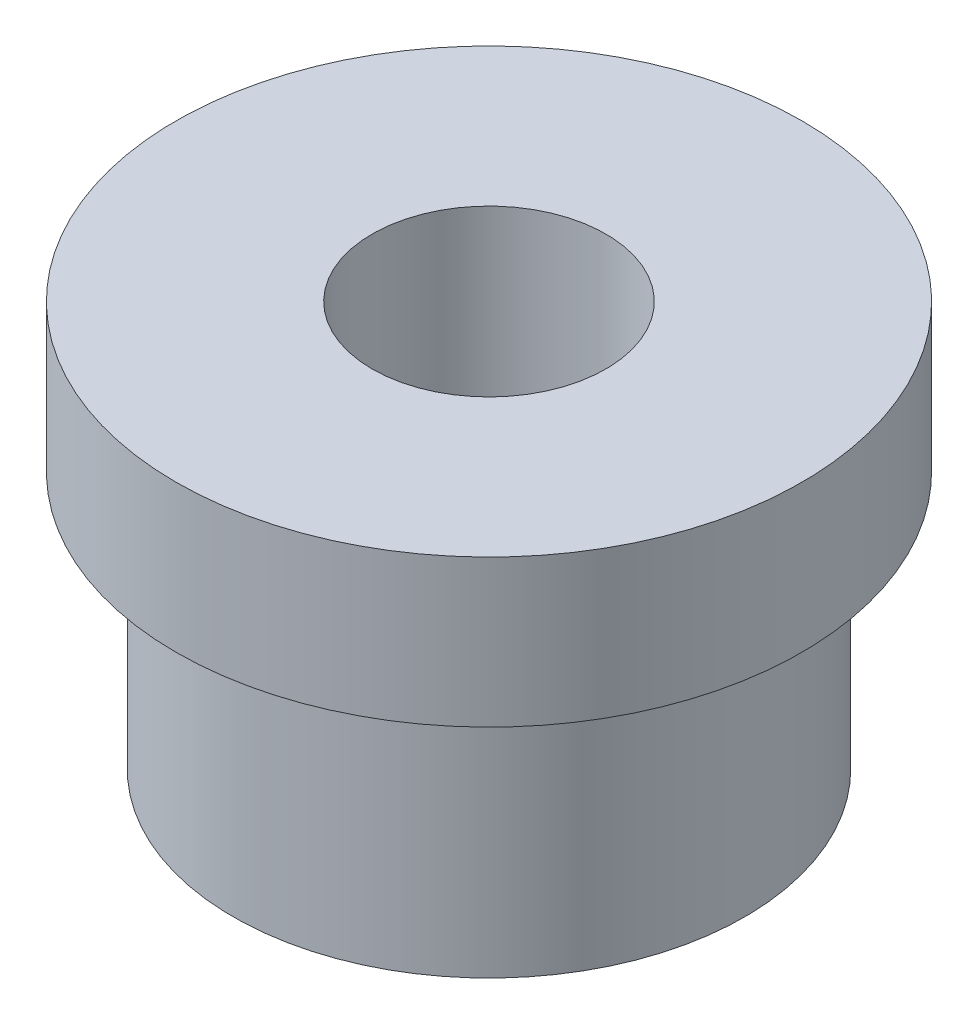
from build123d import *

# Parameters (mm, degrees)
F_1_8_0_125_DIAMETER_HOLE1_D = 3.175


with BuildPart() as part:
    # Sketch3 → Revolve1 (revolve)
    with BuildSketch(Plane(origin=(0, 0, 0), x_dir=(0, 0, -1), z_dir=(1, 0, 0)), mode=Mode.PRIVATE) as revolve1_sk:
        Polygon((0, 2.75), (-4.25, 2.75), (-4.25, 0.75), (-3.47345, 0.75), (-3.47345, -2.75), (0, -2.75), align=None)
    revolve(revolve1_sk.sketch.rotate(Axis((0, -50, 0), (0, 1, 0)), 180), axis=Axis((0, -50, 0), (0, 1, 0)))

    # 1_8 _0.125_ Diameter Hole1 (through all)
    with Locations(Plane(origin=(0, 2.75, 0), x_dir=(1, 0, 0), z_dir=(0, 1, 0))):
        with Locations((0, 0)):
            Hole(F_1_8_0_125_DIAMETER_HOLE1_D / 2)


solid = part.part
